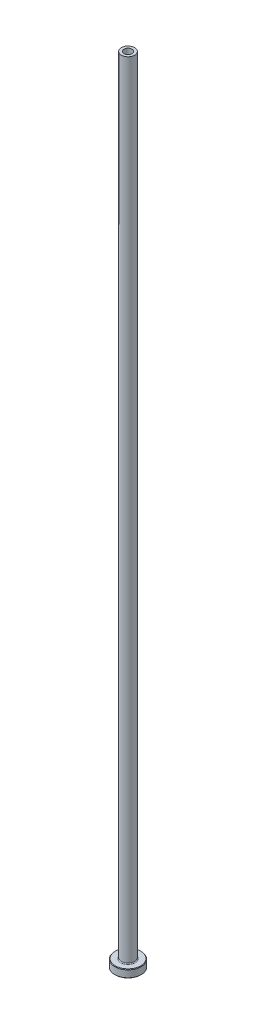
from build123d import *

# Parameters (mm, degrees)
FILLET1_R     = 0.3
CHAMFER1_SIZE = 0.2
CHAMFER3_SIZE = 0.5


with BuildPart() as part:
    # Sketch1 → Revolve1 (revolve)
    with BuildSketch(Plane.XY, mode=Mode.PRIVATE) as revolve1_sk:
        Polygon((-1.5, 300), (-2.5, 300), (-2.5, 3), (-5, 3), (-5, 0), (-1.75, 0), (-1.75, 243), (-1.5, 255), align=None)
    revolve(revolve1_sk.sketch.rotate(Axis((0, 92.187680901, 0), (0, -1, 0)), 270), axis=Axis((0, 92.187680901, 0), (0, -1, 0)))

    # Fillet1
    fillet1_edges = [part.edges().sort_by_distance(p)[0] for p in [
        (0, 3, -2.5),
    ]]
    fillet(fillet1_edges, radius=FILLET1_R)

    # Chamfer1
    chamfer1_edges = [part.edges().sort_by_distance(p)[0] for p in [
        (0, 0, -5),
        (0, 3, -5),
    ]]
    chamfer(chamfer1_edges, length=CHAMFER1_SIZE)

    # Chamfer3
    chamfer3_edges = [part.edges().sort_by_distance(p)[0] for p in [
        (0, 0, -1.75),
    ]]
    chamfer(chamfer3_edges, length=CHAMFER3_SIZE)


solid = part.part
